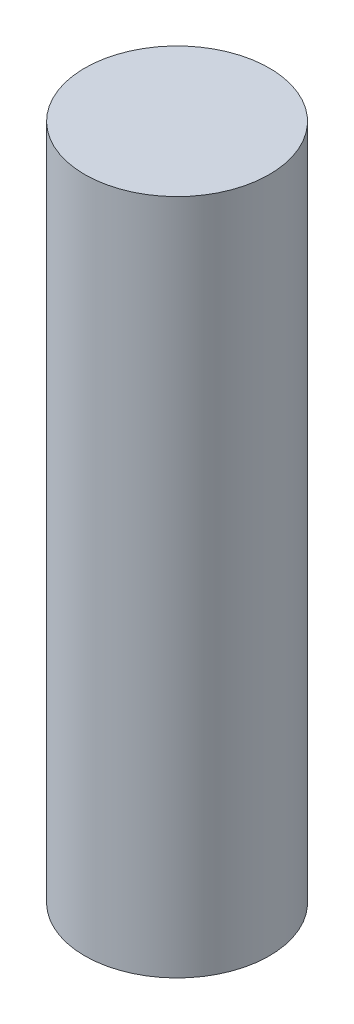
ISO-10303-21;
HEADER;
FILE_DESCRIPTION(('STEP AP214'),'2;1');
FILE_NAME('part.step','',(''),(''),'','','');
FILE_SCHEMA(('AUTOMOTIVE_DESIGN { 1 0 10303 214 1 1 1 1 }'));
ENDSEC;
DATA;
#1=APPLICATION_CONTEXT('core data for automotive mechanical design processes');
#2=APPLICATION_PROTOCOL_DEFINITION('international standard','automotive_design',2000,#1);
#3=PRODUCT_CONTEXT('',#1,'mechanical');
#4=PRODUCT('Part','Part','',(#3));
#5=PRODUCT_RELATED_PRODUCT_CATEGORY('part','',(#4));
#6=PRODUCT_DEFINITION_FORMATION('','',#4);
#7=PRODUCT_DEFINITION_CONTEXT('part definition',#1,'design');
#8=PRODUCT_DEFINITION('design','',#6,#7);
#9=PRODUCT_DEFINITION_SHAPE('','',#8);
#10=(LENGTH_UNIT() NAMED_UNIT(*) SI_UNIT(.MILLI.,.METRE.));
#11=(NAMED_UNIT(*) PLANE_ANGLE_UNIT() SI_UNIT($,.RADIAN.));
#12=(NAMED_UNIT(*) SI_UNIT($,.STERADIAN.) SOLID_ANGLE_UNIT());
#13=UNCERTAINTY_MEASURE_WITH_UNIT(LENGTH_MEASURE(1.E-05),#10,'distance_accuracy_value','');
#14=(GEOMETRIC_REPRESENTATION_CONTEXT(3) GLOBAL_UNCERTAINTY_ASSIGNED_CONTEXT((#13)) GLOBAL_UNIT_ASSIGNED_CONTEXT((#10,
#11,#12)) REPRESENTATION_CONTEXT('',''));
#15=CARTESIAN_POINT('',(0.,0.,0.));
#16=DIRECTION('',(0.,0.,1.));
#17=DIRECTION('',(1.,0.,0.));
#18=AXIS2_PLACEMENT_3D('',#15,#16,#17);
#19=CARTESIAN_POINT('',(0.,34.925,0.));
#20=DIRECTION('',(0.,-1.,0.));
#21=DIRECTION('',(0.,0.,-1.));
#22=AXIS2_PLACEMENT_3D('',#19,#20,#21);
#23=CYLINDRICAL_SURFACE('',#22,4.7625);
#24=CARTESIAN_POINT('',(0.,34.925,0.));
#25=DIRECTION('',(0.,1.,0.));
#26=DIRECTION('',(0.,0.,1.));
#27=AXIS2_PLACEMENT_3D('',#24,#25,#26);
#28=CIRCLE('',#27,4.7625);
#29=CARTESIAN_POINT('',(0.,34.925,4.7625));
#30=VERTEX_POINT('',#29);
#31=EDGE_CURVE('E10',#30,#30,#28,.T.);
#32=ORIENTED_EDGE('',*,*,#31,.F.);
#33=EDGE_LOOP('',(#32));
#34=FACE_BOUND('',#33,.T.);
#35=CARTESIAN_POINT('',(0.,0.,0.));
#36=DIRECTION('',(0.,1.,0.));
#37=DIRECTION('',(0.,0.,1.));
#38=AXIS2_PLACEMENT_3D('',#35,#36,#37);
#39=CIRCLE('',#38,4.7625);
#40=CARTESIAN_POINT('',(0.,0.,4.7625));
#41=VERTEX_POINT('',#40);
#42=EDGE_CURVE('E34',#41,#41,#39,.T.);
#43=ORIENTED_EDGE('',*,*,#42,.T.);
#44=EDGE_LOOP('',(#43));
#45=FACE_BOUND('',#44,.T.);
#46=ADVANCED_FACE('F31',(#34,#45),#23,.T.);
#47=CARTESIAN_POINT('',(0.,34.925,0.));
#48=DIRECTION('',(0.,1.,0.));
#49=DIRECTION('',(0.,0.,1.));
#50=AXIS2_PLACEMENT_3D('',#47,#48,#49);
#51=PLANE('',#50);
#52=ORIENTED_EDGE('',*,*,#31,.T.);
#53=EDGE_LOOP('',(#52));
#54=FACE_BOUND('',#53,.T.);
#55=ADVANCED_FACE('F46',(#54),#51,.T.);
#56=CARTESIAN_POINT('',(0.,0.,0.));
#57=DIRECTION('',(0.,1.,0.));
#58=DIRECTION('',(0.,0.,1.));
#59=AXIS2_PLACEMENT_3D('',#56,#57,#58);
#60=PLANE('',#59);
#61=ORIENTED_EDGE('',*,*,#42,.F.);
#62=EDGE_LOOP('',(#61));
#63=FACE_BOUND('',#62,.T.);
#64=ADVANCED_FACE('F44',(#63),#60,.F.);
#65=CLOSED_SHELL('',(#46,#55,#64));
#66=MANIFOLD_SOLID_BREP('B2',#65);
#67=ADVANCED_BREP_SHAPE_REPRESENTATION('',(#18,#66),#14);
#68=SHAPE_DEFINITION_REPRESENTATION(#9,#67);
ENDSEC;
END-ISO-10303-21;
